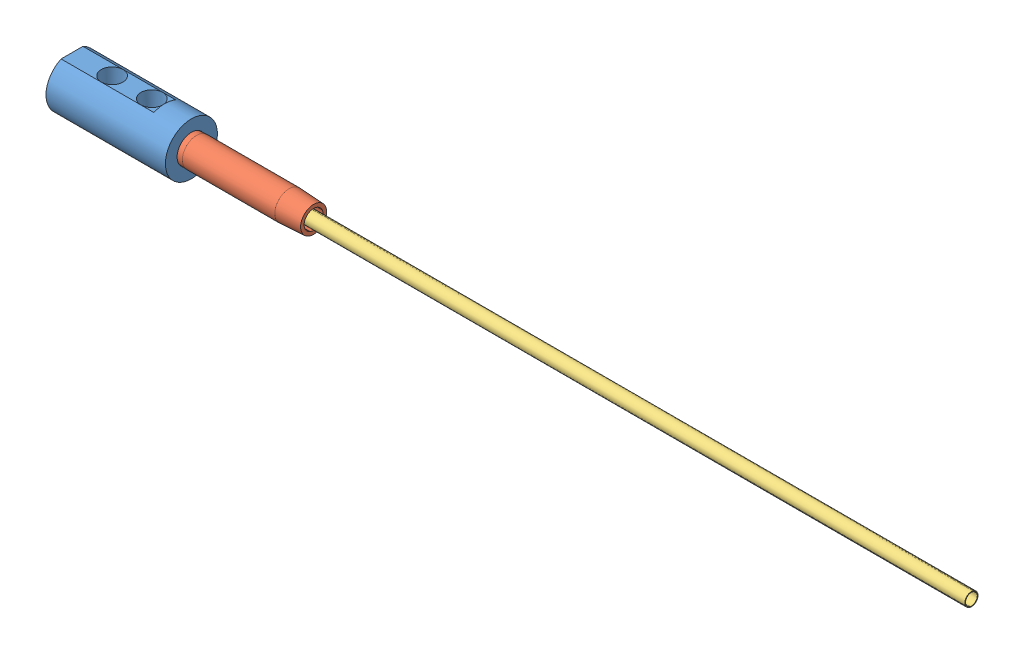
SolidWorks assembly HKC1816.sldasm, configuration Default (file format 11000). Lengths in mm.
Overall size (322.76 18.67 18.67).
3 component instances, 3 part files, 3 mates.
Components (placement in the parent):
- HKCH1816-1: HKCH1816.sldprt [Default] at (0 -9.3345 0) x (1 0 0) z (0 1 0) size (42.85 18.67 18.67)
- GPN12L2-1: GPN12L2.sldprt [Default] at (35.9156 0 0) x (1 0 0) z (0 0.120311 0.992736) size (50.8 10.29 10.29)
- HFT187L12-1: HFT187L12.SLDPRT [Default] at (17.9578 0 0) x (0 -0.435245 -0.900312) z (0 -0.900312 0.435245) size (6.35 304.8 6.35)
Mates (geometry in assembly coordinates):
- ProfileCenter1: profile center: plane of GPN12L2-1 through (35.9156 4.6478 -0.5633) normal (-1 0 0); circle of HKCH1816-1
- Coincident1: coincident: plane of HKCH1816-1 through (17.9578 2.7775 0) normal (1 0 0); plane of HFT187L12-1 through (17.9578 -10.9607 -3.8592) normal (-1 0 0)
- Concentric1: concentric: cylinder of HKCH1816-1 through (35.9156 0 0) axis (-1 0 0) radius 2.7775; cylinder of HFT187L12-1 through (17.9578 0 0) axis (-1 0 0) radius 3.175
